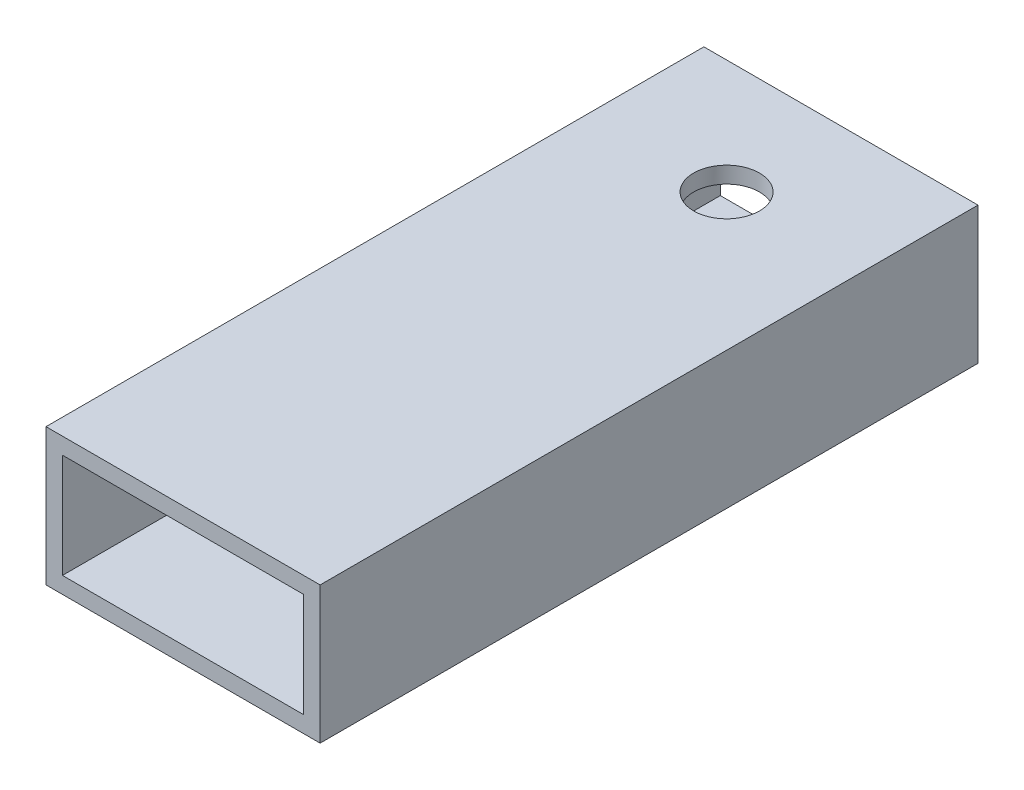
ISO-10303-21;
HEADER;
FILE_DESCRIPTION(('STEP AP214'),'2;1');
FILE_NAME('part.step','',(''),(''),'','','');
FILE_SCHEMA(('AUTOMOTIVE_DESIGN { 1 0 10303 214 1 1 1 1 }'));
ENDSEC;
DATA;
#1=APPLICATION_CONTEXT('core data for automotive mechanical design processes');
#2=APPLICATION_PROTOCOL_DEFINITION('international standard','automotive_design',2000,#1);
#3=PRODUCT_CONTEXT('',#1,'mechanical');
#4=PRODUCT('Part','Part','',(#3));
#5=PRODUCT_RELATED_PRODUCT_CATEGORY('part','',(#4));
#6=PRODUCT_DEFINITION_FORMATION('','',#4);
#7=PRODUCT_DEFINITION_CONTEXT('part definition',#1,'design');
#8=PRODUCT_DEFINITION('design','',#6,#7);
#9=PRODUCT_DEFINITION_SHAPE('','',#8);
#10=(LENGTH_UNIT() NAMED_UNIT(*) SI_UNIT(.MILLI.,.METRE.));
#11=(NAMED_UNIT(*) PLANE_ANGLE_UNIT() SI_UNIT($,.RADIAN.));
#12=(NAMED_UNIT(*) SI_UNIT($,.STERADIAN.) SOLID_ANGLE_UNIT());
#13=UNCERTAINTY_MEASURE_WITH_UNIT(LENGTH_MEASURE(1.E-05),#10,'distance_accuracy_value','');
#14=(GEOMETRIC_REPRESENTATION_CONTEXT(3) GLOBAL_UNCERTAINTY_ASSIGNED_CONTEXT((#13)) GLOBAL_UNIT_ASSIGNED_CONTEXT((#10,
#11,#12)) REPRESENTATION_CONTEXT('',''));
#15=CARTESIAN_POINT('',(0.,0.,0.));
#16=DIRECTION('',(0.,0.,1.));
#17=DIRECTION('',(1.,0.,0.));
#18=AXIS2_PLACEMENT_3D('',#15,#16,#17);
#19=CARTESIAN_POINT('',(0.,25.,120.));
#20=DIRECTION('',(0.,0.,-1.));
#21=DIRECTION('',(-1.,0.,0.));
#22=AXIS2_PLACEMENT_3D('',#19,#20,#21);
#23=PLANE('',#22);
#24=DIRECTION('',(0.,-1.,0.));
#25=VECTOR('',#24,1.);
#26=CARTESIAN_POINT('',(0.,0.,120.));
#27=LINE('',#26,#25);
#28=CARTESIAN_POINT('',(0.,25.,120.));
#29=VERTEX_POINT('',#28);
#30=CARTESIAN_POINT('',(0.,0.,120.));
#31=VERTEX_POINT('',#30);
#32=EDGE_CURVE('E145',#29,#31,#27,.T.);
#33=ORIENTED_EDGE('',*,*,#32,.T.);
#34=DIRECTION('',(1.,0.,0.));
#35=VECTOR('',#34,1.);
#36=CARTESIAN_POINT('',(0.,0.,120.));
#37=LINE('',#36,#35);
#38=CARTESIAN_POINT('',(50.,0.,120.));
#39=VERTEX_POINT('',#38);
#40=EDGE_CURVE('E148',#31,#39,#37,.T.);
#41=ORIENTED_EDGE('',*,*,#40,.T.);
#42=DIRECTION('',(0.,1.,0.));
#43=VECTOR('',#42,1.);
#44=CARTESIAN_POINT('',(50.,0.,120.));
#45=LINE('',#44,#43);
#46=CARTESIAN_POINT('',(50.,25.,120.));
#47=VERTEX_POINT('',#46);
#48=EDGE_CURVE('E150',#39,#47,#45,.T.);
#49=ORIENTED_EDGE('',*,*,#48,.T.);
#50=DIRECTION('',(-1.,0.,0.));
#51=VECTOR('',#50,1.);
#52=CARTESIAN_POINT('',(0.,25.,120.));
#53=LINE('',#52,#51);
#54=EDGE_CURVE('E152',#47,#29,#53,.T.);
#55=ORIENTED_EDGE('',*,*,#54,.T.);
#56=EDGE_LOOP('',(#33,#41,#49,#55));
#57=FACE_BOUND('',#56,.T.);
#58=DIRECTION('',(0.,-1.,0.));
#59=VECTOR('',#58,1.);
#60=CARTESIAN_POINT('',(3.,22.,120.));
#61=LINE('',#60,#59);
#62=CARTESIAN_POINT('',(3.,22.,120.));
#63=VERTEX_POINT('',#62);
#64=CARTESIAN_POINT('',(3.,3.,120.));
#65=VERTEX_POINT('',#64);
#66=EDGE_CURVE('E112',#63,#65,#61,.T.);
#67=ORIENTED_EDGE('',*,*,#66,.F.);
#68=DIRECTION('',(-1.,0.,0.));
#69=VECTOR('',#68,1.);
#70=CARTESIAN_POINT('',(3.,22.,120.));
#71=LINE('',#70,#69);
#72=CARTESIAN_POINT('',(47.,22.,120.));
#73=VERTEX_POINT('',#72);
#74=EDGE_CURVE('E131',#73,#63,#71,.T.);
#75=ORIENTED_EDGE('',*,*,#74,.F.);
#76=DIRECTION('',(0.,1.,0.));
#77=VECTOR('',#76,1.);
#78=CARTESIAN_POINT('',(47.,22.,120.));
#79=LINE('',#78,#77);
#80=CARTESIAN_POINT('',(47.,3.,120.));
#81=VERTEX_POINT('',#80);
#82=EDGE_CURVE('E129',#81,#73,#79,.T.);
#83=ORIENTED_EDGE('',*,*,#82,.F.);
#84=DIRECTION('',(1.,0.,0.));
#85=VECTOR('',#84,1.);
#86=CARTESIAN_POINT('',(3.,3.,120.));
#87=LINE('',#86,#85);
#88=EDGE_CURVE('E127',#65,#81,#87,.T.);
#89=ORIENTED_EDGE('',*,*,#88,.F.);
#90=EDGE_LOOP('',(#67,#75,#83,#89));
#91=FACE_BOUND('',#90,.T.);
#92=ADVANCED_FACE('F31',(#57,#91),#23,.F.);
#93=CARTESIAN_POINT('',(0.,25.,0.));
#94=DIRECTION('',(0.,0.,-1.));
#95=DIRECTION('',(-1.,0.,0.));
#96=AXIS2_PLACEMENT_3D('',#93,#94,#95);
#97=PLANE('',#96);
#98=DIRECTION('',(0.,-1.,0.));
#99=VECTOR('',#98,1.);
#100=CARTESIAN_POINT('',(0.,0.,0.));
#101=LINE('',#100,#99);
#102=CARTESIAN_POINT('',(0.,25.,0.));
#103=VERTEX_POINT('',#102);
#104=CARTESIAN_POINT('',(0.,0.,0.));
#105=VERTEX_POINT('',#104);
#106=EDGE_CURVE('E113',#103,#105,#101,.T.);
#107=ORIENTED_EDGE('',*,*,#106,.F.);
#108=DIRECTION('',(-1.,0.,0.));
#109=VECTOR('',#108,1.);
#110=CARTESIAN_POINT('',(0.,25.,0.));
#111=LINE('',#110,#109);
#112=CARTESIAN_POINT('',(50.,25.,0.));
#113=VERTEX_POINT('',#112);
#114=EDGE_CURVE('E143',#113,#103,#111,.T.);
#115=ORIENTED_EDGE('',*,*,#114,.F.);
#116=DIRECTION('',(0.,1.,0.));
#117=VECTOR('',#116,1.);
#118=CARTESIAN_POINT('',(50.,0.,0.));
#119=LINE('',#118,#117);
#120=CARTESIAN_POINT('',(50.,0.,0.));
#121=VERTEX_POINT('',#120);
#122=EDGE_CURVE('E141',#121,#113,#119,.T.);
#123=ORIENTED_EDGE('',*,*,#122,.F.);
#124=DIRECTION('',(1.,0.,0.));
#125=VECTOR('',#124,1.);
#126=CARTESIAN_POINT('',(0.,0.,0.));
#127=LINE('',#126,#125);
#128=EDGE_CURVE('E139',#105,#121,#127,.T.);
#129=ORIENTED_EDGE('',*,*,#128,.F.);
#130=EDGE_LOOP('',(#107,#115,#123,#129));
#131=FACE_BOUND('',#130,.T.);
#132=DIRECTION('',(-1.,0.,0.));
#133=VECTOR('',#132,1.);
#134=CARTESIAN_POINT('',(3.,22.,0.));
#135=LINE('',#134,#133);
#136=CARTESIAN_POINT('',(47.,22.,0.));
#137=VERTEX_POINT('',#136);
#138=CARTESIAN_POINT('',(3.,22.,0.));
#139=VERTEX_POINT('',#138);
#140=EDGE_CURVE('E117',#137,#139,#135,.T.);
#141=ORIENTED_EDGE('',*,*,#140,.T.);
#142=DIRECTION('',(0.,-1.,0.));
#143=VECTOR('',#142,1.);
#144=CARTESIAN_POINT('',(3.,22.,0.));
#145=LINE('',#144,#143);
#146=CARTESIAN_POINT('',(3.,3.,0.));
#147=VERTEX_POINT('',#146);
#148=EDGE_CURVE('E55',#139,#147,#145,.T.);
#149=ORIENTED_EDGE('',*,*,#148,.T.);
#150=DIRECTION('',(1.,0.,0.));
#151=VECTOR('',#150,1.);
#152=CARTESIAN_POINT('',(3.,3.,0.));
#153=LINE('',#152,#151);
#154=CARTESIAN_POINT('',(47.,3.,0.));
#155=VERTEX_POINT('',#154);
#156=EDGE_CURVE('E99',#147,#155,#153,.T.);
#157=ORIENTED_EDGE('',*,*,#156,.T.);
#158=DIRECTION('',(0.,1.,0.));
#159=VECTOR('',#158,1.);
#160=CARTESIAN_POINT('',(47.,22.,0.));
#161=LINE('',#160,#159);
#162=EDGE_CURVE('E108',#155,#137,#161,.T.);
#163=ORIENTED_EDGE('',*,*,#162,.T.);
#164=EDGE_LOOP('',(#141,#149,#157,#163));
#165=FACE_BOUND('',#164,.T.);
#166=ADVANCED_FACE('F116',(#131,#165),#97,.T.);
#167=CARTESIAN_POINT('',(0.,0.,120.));
#168=DIRECTION('',(1.,0.,0.));
#169=DIRECTION('',(0.,0.,-1.));
#170=AXIS2_PLACEMENT_3D('',#167,#168,#169);
#171=PLANE('',#170);
#172=ORIENTED_EDGE('',*,*,#106,.T.);
#173=DIRECTION('',(0.,0.,-1.));
#174=VECTOR('',#173,1.);
#175=CARTESIAN_POINT('',(0.,0.,120.));
#176=LINE('',#175,#174);
#177=EDGE_CURVE('E11',#31,#105,#176,.T.);
#178=ORIENTED_EDGE('',*,*,#177,.F.);
#179=ORIENTED_EDGE('',*,*,#32,.F.);
#180=DIRECTION('',(0.,0.,-1.));
#181=VECTOR('',#180,1.);
#182=CARTESIAN_POINT('',(0.,25.,120.));
#183=LINE('',#182,#181);
#184=EDGE_CURVE('E154',#29,#103,#183,.T.);
#185=ORIENTED_EDGE('',*,*,#184,.T.);
#186=EDGE_LOOP('',(#172,#178,#179,#185));
#187=FACE_BOUND('',#186,.T.);
#188=ADVANCED_FACE('F33',(#187),#171,.F.);
#189=CARTESIAN_POINT('',(0.,0.,120.));
#190=DIRECTION('',(0.,1.,0.));
#191=DIRECTION('',(0.,0.,1.));
#192=AXIS2_PLACEMENT_3D('',#189,#190,#191);
#193=PLANE('',#192);
#194=CARTESIAN_POINT('',(25.,0.,20.8608608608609));
#195=DIRECTION('',(0.,1.,0.));
#196=DIRECTION('',(0.,0.,1.));
#197=AXIS2_PLACEMENT_3D('',#194,#195,#196);
#198=CIRCLE('',#197,6.);
#199=CARTESIAN_POINT('',(25.,0.,26.8608608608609));
#200=VERTEX_POINT('',#199);
#201=EDGE_CURVE('E206',#200,#200,#198,.T.);
#202=ORIENTED_EDGE('',*,*,#201,.T.);
#203=EDGE_LOOP('',(#202));
#204=FACE_BOUND('',#203,.T.);
#205=ORIENTED_EDGE('',*,*,#128,.T.);
#206=DIRECTION('',(0.,0.,-1.));
#207=VECTOR('',#206,1.);
#208=CARTESIAN_POINT('',(50.,0.,120.));
#209=LINE('',#208,#207);
#210=EDGE_CURVE('E40',#39,#121,#209,.T.);
#211=ORIENTED_EDGE('',*,*,#210,.F.);
#212=ORIENTED_EDGE('',*,*,#40,.F.);
#213=ORIENTED_EDGE('',*,*,#177,.T.);
#214=EDGE_LOOP('',(#205,#211,#212,#213));
#215=FACE_BOUND('',#214,.T.);
#216=ADVANCED_FACE('F180',(#204,#215),#193,.F.);
#217=CARTESIAN_POINT('',(50.,0.,120.));
#218=DIRECTION('',(-1.,0.,0.));
#219=DIRECTION('',(0.,0.,1.));
#220=AXIS2_PLACEMENT_3D('',#217,#218,#219);
#221=PLANE('',#220);
#222=ORIENTED_EDGE('',*,*,#122,.T.);
#223=DIRECTION('',(0.,0.,-1.));
#224=VECTOR('',#223,1.);
#225=CARTESIAN_POINT('',(50.,25.,120.));
#226=LINE('',#225,#224);
#227=EDGE_CURVE('E157',#47,#113,#226,.T.);
#228=ORIENTED_EDGE('',*,*,#227,.F.);
#229=ORIENTED_EDGE('',*,*,#48,.F.);
#230=ORIENTED_EDGE('',*,*,#210,.T.);
#231=EDGE_LOOP('',(#222,#228,#229,#230));
#232=FACE_BOUND('',#231,.T.);
#233=ADVANCED_FACE('F165',(#232),#221,.F.);
#234=CARTESIAN_POINT('',(0.,25.,120.));
#235=DIRECTION('',(0.,-1.,0.));
#236=DIRECTION('',(0.,0.,-1.));
#237=AXIS2_PLACEMENT_3D('',#234,#235,#236);
#238=PLANE('',#237);
#239=CARTESIAN_POINT('',(25.,25.,20.8608608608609));
#240=DIRECTION('',(0.,1.,0.));
#241=DIRECTION('',(0.,0.,1.));
#242=AXIS2_PLACEMENT_3D('',#239,#240,#241);
#243=CIRCLE('',#242,6.);
#244=CARTESIAN_POINT('',(25.,25.,26.8608608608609));
#245=VERTEX_POINT('',#244);
#246=EDGE_CURVE('E204',#245,#245,#243,.T.);
#247=ORIENTED_EDGE('',*,*,#246,.F.);
#248=EDGE_LOOP('',(#247));
#249=FACE_BOUND('',#248,.T.);
#250=ORIENTED_EDGE('',*,*,#114,.T.);
#251=ORIENTED_EDGE('',*,*,#184,.F.);
#252=ORIENTED_EDGE('',*,*,#54,.F.);
#253=ORIENTED_EDGE('',*,*,#227,.T.);
#254=EDGE_LOOP('',(#250,#251,#252,#253));
#255=FACE_BOUND('',#254,.T.);
#256=ADVANCED_FACE('F173',(#249,#255),#238,.F.);
#257=CARTESIAN_POINT('',(3.,22.,120.));
#258=DIRECTION('',(1.,0.,0.));
#259=DIRECTION('',(0.,1.,0.));
#260=AXIS2_PLACEMENT_3D('',#257,#258,#259);
#261=PLANE('',#260);
#262=ORIENTED_EDGE('',*,*,#148,.F.);
#263=DIRECTION('',(0.,0.,-1.));
#264=VECTOR('',#263,1.);
#265=CARTESIAN_POINT('',(3.,22.,120.));
#266=LINE('',#265,#264);
#267=EDGE_CURVE('E133',#63,#139,#266,.T.);
#268=ORIENTED_EDGE('',*,*,#267,.F.);
#269=ORIENTED_EDGE('',*,*,#66,.T.);
#270=DIRECTION('',(0.,0.,-1.));
#271=VECTOR('',#270,1.);
#272=CARTESIAN_POINT('',(3.,3.,120.));
#273=LINE('',#272,#271);
#274=EDGE_CURVE('E101',#65,#147,#273,.T.);
#275=ORIENTED_EDGE('',*,*,#274,.T.);
#276=EDGE_LOOP('',(#262,#268,#269,#275));
#277=FACE_BOUND('',#276,.T.);
#278=ADVANCED_FACE('F110',(#277),#261,.T.);
#279=CARTESIAN_POINT('',(3.,3.,120.));
#280=DIRECTION('',(0.,1.,0.));
#281=DIRECTION('',(0.,0.,1.));
#282=AXIS2_PLACEMENT_3D('',#279,#280,#281);
#283=PLANE('',#282);
#284=CARTESIAN_POINT('',(25.,3.,20.8608608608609));
#285=DIRECTION('',(0.,1.,0.));
#286=DIRECTION('',(0.,0.,1.));
#287=AXIS2_PLACEMENT_3D('',#284,#285,#286);
#288=CIRCLE('',#287,6.);
#289=CARTESIAN_POINT('',(25.,3.,26.8608608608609));
#290=VERTEX_POINT('',#289);
#291=EDGE_CURVE('E118',#290,#290,#288,.T.);
#292=ORIENTED_EDGE('',*,*,#291,.F.);
#293=EDGE_LOOP('',(#292));
#294=FACE_BOUND('',#293,.T.);
#295=ORIENTED_EDGE('',*,*,#156,.F.);
#296=ORIENTED_EDGE('',*,*,#274,.F.);
#297=ORIENTED_EDGE('',*,*,#88,.T.);
#298=DIRECTION('',(0.,0.,-1.));
#299=VECTOR('',#298,1.);
#300=CARTESIAN_POINT('',(47.,3.,120.));
#301=LINE('',#300,#299);
#302=EDGE_CURVE('E104',#81,#155,#301,.T.);
#303=ORIENTED_EDGE('',*,*,#302,.T.);
#304=EDGE_LOOP('',(#295,#296,#297,#303));
#305=FACE_BOUND('',#304,.T.);
#306=ADVANCED_FACE('F100',(#294,#305),#283,.T.);
#307=CARTESIAN_POINT('',(47.,22.,120.));
#308=DIRECTION('',(-1.,0.,0.));
#309=DIRECTION('',(0.,0.,1.));
#310=AXIS2_PLACEMENT_3D('',#307,#308,#309);
#311=PLANE('',#310);
#312=ORIENTED_EDGE('',*,*,#162,.F.);
#313=ORIENTED_EDGE('',*,*,#302,.F.);
#314=ORIENTED_EDGE('',*,*,#82,.T.);
#315=DIRECTION('',(0.,0.,-1.));
#316=VECTOR('',#315,1.);
#317=CARTESIAN_POINT('',(47.,22.,120.));
#318=LINE('',#317,#316);
#319=EDGE_CURVE('E47',#73,#137,#318,.T.);
#320=ORIENTED_EDGE('',*,*,#319,.T.);
#321=EDGE_LOOP('',(#312,#313,#314,#320));
#322=FACE_BOUND('',#321,.T.);
#323=ADVANCED_FACE('F216',(#322),#311,.T.);
#324=CARTESIAN_POINT('',(3.,22.,120.));
#325=DIRECTION('',(0.,-1.,0.));
#326=DIRECTION('',(0.,0.,-1.));
#327=AXIS2_PLACEMENT_3D('',#324,#325,#326);
#328=PLANE('',#327);
#329=CARTESIAN_POINT('',(25.,22.,20.8608608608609));
#330=DIRECTION('',(0.,-1.,0.));
#331=DIRECTION('',(0.,0.,-1.));
#332=AXIS2_PLACEMENT_3D('',#329,#330,#331);
#333=CIRCLE('',#332,6.);
#334=CARTESIAN_POINT('',(25.,22.,14.8608608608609));
#335=VERTEX_POINT('',#334);
#336=EDGE_CURVE('E35',#335,#335,#333,.T.);
#337=ORIENTED_EDGE('',*,*,#336,.F.);
#338=EDGE_LOOP('',(#337));
#339=FACE_BOUND('',#338,.T.);
#340=ORIENTED_EDGE('',*,*,#140,.F.);
#341=ORIENTED_EDGE('',*,*,#319,.F.);
#342=ORIENTED_EDGE('',*,*,#74,.T.);
#343=ORIENTED_EDGE('',*,*,#267,.T.);
#344=EDGE_LOOP('',(#340,#341,#342,#343));
#345=FACE_BOUND('',#344,.T.);
#346=ADVANCED_FACE('F214',(#339,#345),#328,.T.);
#347=CARTESIAN_POINT('',(25.,0.,20.8608608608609));
#348=DIRECTION('',(0.,1.,0.));
#349=DIRECTION('',(0.,0.,1.));
#350=AXIS2_PLACEMENT_3D('',#347,#348,#349);
#351=CYLINDRICAL_SURFACE('',#350,6.);
#352=ORIENTED_EDGE('',*,*,#336,.T.);
#353=EDGE_LOOP('',(#352));
#354=FACE_BOUND('',#353,.T.);
#355=ORIENTED_EDGE('',*,*,#246,.T.);
#356=EDGE_LOOP('',(#355));
#357=FACE_BOUND('',#356,.T.);
#358=ADVANCED_FACE('F212',(#354,#357),#351,.F.);
#359=ORIENTED_EDGE('',*,*,#291,.T.);
#360=EDGE_LOOP('',(#359));
#361=FACE_BOUND('',#360,.T.);
#362=ORIENTED_EDGE('',*,*,#201,.F.);
#363=EDGE_LOOP('',(#362));
#364=FACE_BOUND('',#363,.T.);
#365=ADVANCED_FACE('F230',(#361,#364),#351,.F.);
#366=CLOSED_SHELL('',(#92,#166,#188,#216,#233,#256,#278,#306,#323,#346,#358,#365));
#367=MANIFOLD_SOLID_BREP('B2',#366);
#368=ADVANCED_BREP_SHAPE_REPRESENTATION('',(#18,#367),#14);
#369=SHAPE_DEFINITION_REPRESENTATION(#9,#368);
ENDSEC;
END-ISO-10303-21;
